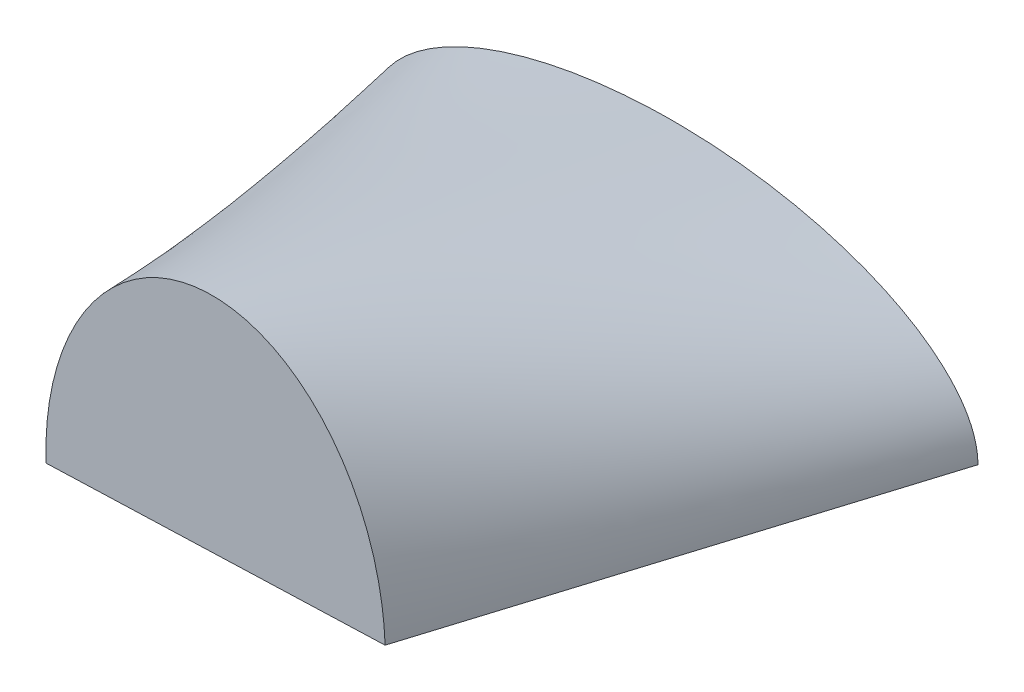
ISO-10303-21;
HEADER;
FILE_DESCRIPTION(('STEP AP214'),'2;1');
FILE_NAME('part.step','',(''),(''),'','','');
FILE_SCHEMA(('AUTOMOTIVE_DESIGN { 1 0 10303 214 1 1 1 1 }'));
ENDSEC;
DATA;
#1=APPLICATION_CONTEXT('core data for automotive mechanical design processes');
#2=APPLICATION_PROTOCOL_DEFINITION('international standard','automotive_design',2000,#1);
#3=PRODUCT_CONTEXT('',#1,'mechanical');
#4=PRODUCT('Part','Part','',(#3));
#5=PRODUCT_RELATED_PRODUCT_CATEGORY('part','',(#4));
#6=PRODUCT_DEFINITION_FORMATION('','',#4);
#7=PRODUCT_DEFINITION_CONTEXT('part definition',#1,'design');
#8=PRODUCT_DEFINITION('design','',#6,#7);
#9=PRODUCT_DEFINITION_SHAPE('','',#8);
#10=(LENGTH_UNIT() NAMED_UNIT(*) SI_UNIT(.MILLI.,.METRE.));
#11=(NAMED_UNIT(*) PLANE_ANGLE_UNIT() SI_UNIT($,.RADIAN.));
#12=(NAMED_UNIT(*) SI_UNIT($,.STERADIAN.) SOLID_ANGLE_UNIT());
#13=UNCERTAINTY_MEASURE_WITH_UNIT(LENGTH_MEASURE(1.E-05),#10,'distance_accuracy_value','');
#14=(GEOMETRIC_REPRESENTATION_CONTEXT(3) GLOBAL_UNCERTAINTY_ASSIGNED_CONTEXT((#13)) GLOBAL_UNIT_ASSIGNED_CONTEXT((#10,
#11,#12)) REPRESENTATION_CONTEXT('',''));
#15=CARTESIAN_POINT('',(0.,0.,0.));
#16=DIRECTION('',(0.,0.,1.));
#17=DIRECTION('',(1.,0.,0.));
#18=AXIS2_PLACEMENT_3D('',#15,#16,#17);
#19=CARTESIAN_POINT('',(62.9135174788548,0.,0.));
#20=DIRECTION('',(0.,0.,-1.));
#21=DIRECTION('',(-1.,0.,0.));
#22=AXIS2_PLACEMENT_3D('',#19,#20,#21);
#23=PLANE('',#22);
#24=DIRECTION('',(-1.,0.,0.));
#25=VECTOR('',#24,1.);
#26=CARTESIAN_POINT('',(0.,0.,0.));
#27=LINE('',#26,#25);
#28=CARTESIAN_POINT('',(62.9135174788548,0.,0.));
#29=VERTEX_POINT('',#28);
#30=CARTESIAN_POINT('',(-62.9135174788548,0.,0.));
#31=VERTEX_POINT('',#30);
#32=EDGE_CURVE('E131',#29,#31,#27,.T.);
#33=ORIENTED_EDGE('',*,*,#32,.T.);
#34=CARTESIAN_POINT('',(62.9135174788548,0.,0.));
#35=CARTESIAN_POINT('',(62.9135592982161,0.299753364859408,0.));
#36=CARTESIAN_POINT('',(62.9041604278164,0.599492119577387,0.));
#37=CARTESIAN_POINT('',(62.8668078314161,1.19746476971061,0.));
#38=CARTESIAN_POINT('',(62.8388756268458,1.49570000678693,0.));
#39=CARTESIAN_POINT('',(62.7647962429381,2.08977229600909,0.));
#40=CARTESIAN_POINT('',(62.7186562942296,2.38561025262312,0.));
#41=CARTESIAN_POINT('',(62.609380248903,2.97053276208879,0.));
#42=CARTESIAN_POINT('',(62.5464495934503,3.25965582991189,0.));
#43=CARTESIAN_POINT('',(62.4040437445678,3.8338689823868,0.));
#44=CARTESIAN_POINT('',(62.324564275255,4.11895800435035,0.));
#45=CARTESIAN_POINT('',(62.149896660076,4.68430660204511,0.));
#46=CARTESIAN_POINT('',(62.0547063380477,4.9645655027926,0.));
#47=CARTESIAN_POINT('',(61.8268319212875,5.58102895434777,0.));
#48=CARTESIAN_POINT('',(61.6905120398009,5.91589243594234,0.));
#49=CARTESIAN_POINT('',(61.3975562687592,6.57664066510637,0.));
#50=CARTESIAN_POINT('',(61.2409166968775,6.90252377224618,0.));
#51=CARTESIAN_POINT('',(60.9091120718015,7.54470165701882,0.));
#52=CARTESIAN_POINT('',(60.7339465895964,7.86099621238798,0.));
#53=CARTESIAN_POINT('',(60.3659867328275,8.48506971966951,0.));
#54=CARTESIAN_POINT('',(60.1731158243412,8.79280341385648,0.));
#55=CARTESIAN_POINT('',(59.7720930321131,9.39808960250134,0.));
#56=CARTESIAN_POINT('',(59.5639423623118,9.69564290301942,0.));
#57=CARTESIAN_POINT('',(59.1338636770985,10.2806218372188,0.));
#58=CARTESIAN_POINT('',(58.911934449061,10.5680465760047,0.));
#59=CARTESIAN_POINT('',(58.3259690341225,11.2934947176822,0.));
#60=CARTESIAN_POINT('',(57.9528776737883,11.7242291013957,0.));
#61=CARTESIAN_POINT('',(57.1808113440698,12.5620762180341,0.));
#62=CARTESIAN_POINT('',(56.7818231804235,12.969176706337,0.));
#63=CARTESIAN_POINT('',(55.9619373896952,13.760787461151,0.));
#64=CARTESIAN_POINT('',(55.5410351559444,14.1452929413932,0.));
#65=CARTESIAN_POINT('',(54.6802559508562,14.8932092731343,0.));
#66=CARTESIAN_POINT('',(54.2403614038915,15.2565998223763,0.));
#67=CARTESIAN_POINT('',(53.3447927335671,15.9630541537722,0.));
#68=CARTESIAN_POINT('',(52.8891232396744,16.3061238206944,0.));
#69=CARTESIAN_POINT('',(51.9641482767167,16.9732353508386,0.));
#70=CARTESIAN_POINT('',(51.4948435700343,17.2972782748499,0.));
#71=CARTESIAN_POINT('',(50.3528284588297,18.0545601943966,0.));
#72=CARTESIAN_POINT('',(49.674383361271,18.479161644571,0.));
#73=CARTESIAN_POINT('',(48.2984302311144,19.2960510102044,-1.03628328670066E-13));
#74=CARTESIAN_POINT('',(47.600922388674,19.6883392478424,0.));
#75=CARTESIAN_POINT('',(46.1908183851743,20.4427182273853,0.));
#76=CARTESIAN_POINT('',(45.4782401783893,20.8048426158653,-1.08474907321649E-13));
#77=CARTESIAN_POINT('',(44.0397825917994,21.501568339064,0.));
#78=CARTESIAN_POINT('',(43.3139027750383,21.836168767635,0.));
#79=CARTESIAN_POINT('',(41.4602584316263,22.6516194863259,0.));
#80=CARTESIAN_POINT('',(40.3248595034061,23.1151634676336,0.));
#81=CARTESIAN_POINT('',(38.0333047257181,23.987784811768,-1.31639444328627E-13));
#82=CARTESIAN_POINT('',(36.8771459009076,24.3968542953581,-1.04460580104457E-13));
#83=CARTESIAN_POINT('',(34.5479732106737,25.1652214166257,-1.0769471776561E-13));
#84=CARTESIAN_POINT('',(33.3749530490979,25.5244998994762,-1.38129818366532E-13));
#85=CARTESIAN_POINT('',(31.0158417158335,26.196800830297,0.));
#86=CARTESIAN_POINT('',(29.8297510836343,26.5098251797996,0.));
#87=CARTESIAN_POINT('',(27.4511245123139,27.0916360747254,0.));
#88=CARTESIAN_POINT('',(26.258624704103,27.3605708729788,0.));
#89=CARTESIAN_POINT('',(23.8652516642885,27.857886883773,-1.48523369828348E-13));
#90=CARTESIAN_POINT('',(22.6643785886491,28.0862688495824,-1.21188560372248E-13));
#91=CARTESIAN_POINT('',(20.2544394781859,28.5046641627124,-1.2203792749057E-13));
#92=CARTESIAN_POINT('',(19.0453650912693,28.6946292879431,-1.50291409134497E-13));
#93=CARTESIAN_POINT('',(16.6218762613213,29.0373615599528,0.));
#94=CARTESIAN_POINT('',(15.4074613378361,29.1901252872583,0.));
#95=CARTESIAN_POINT('',(12.3912925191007,29.5242511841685,0.));
#96=CARTESIAN_POINT('',(10.5871330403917,29.6842018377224,0.));
#97=CARTESIAN_POINT('',(6.97291711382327,29.9279160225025,-1.69795719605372E-13));
#98=CARTESIAN_POINT('',(5.16285833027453,30.0116443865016,-1.40171130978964E-13));
#99=CARTESIAN_POINT('',(1.53993072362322,30.1041243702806,-1.1863245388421E-13));
#100=CARTESIAN_POINT('',(-0.272939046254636,30.1128389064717,-1.26737014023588E-13));
#101=CARTESIAN_POINT('',(-3.89836202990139,30.0553169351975,-1.32304962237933E-13));
#102=CARTESIAN_POINT('',(-5.71091468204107,29.9890447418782,-1.29763282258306E-13));
#103=CARTESIAN_POINT('',(-9.32724405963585,29.7807052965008,-1.27517725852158E-13));
#104=CARTESIAN_POINT('',(-11.1310314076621,29.6388225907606,-1.27806969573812E-13));
#105=CARTESIAN_POINT('',(-14.7303753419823,29.277157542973,-1.2569832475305E-13));
#106=CARTESIAN_POINT('',(-16.5259341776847,29.0573979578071,-1.23301220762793E-13));
#107=CARTESIAN_POINT('',(-19.2096591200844,28.6666573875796,-1.24094201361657E-13));
#108=CARTESIAN_POINT('',(-20.1023637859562,28.5262785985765,-1.25089005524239E-13));
#109=CARTESIAN_POINT('',(-21.8842056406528,28.2245145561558,-1.1884487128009E-13));
#110=CARTESIAN_POINT('',(-22.7733429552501,28.0631300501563,-1.11606225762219E-13));
#111=CARTESIAN_POINT('',(-24.546825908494,27.7187405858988,-1.28038537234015E-13));
#112=CARTESIAN_POINT('',(-25.4311742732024,27.5357496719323,-1.51689515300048E-13));
#113=CARTESIAN_POINT('',(-27.1948709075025,27.1472101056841,0.));
#114=CARTESIAN_POINT('',(-28.0742194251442,26.9416625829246,0.));
#115=CARTESIAN_POINT('',(-29.6766960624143,26.5442814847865,0.));
#116=CARTESIAN_POINT('',(-30.4007422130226,26.3561455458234,0.));
#117=CARTESIAN_POINT('',(-31.8441833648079,25.963043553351,-1.39662431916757E-13));
#118=CARTESIAN_POINT('',(-32.5635788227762,25.7580791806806,-1.17537798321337E-13));
#119=CARTESIAN_POINT('',(-33.9971189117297,25.330549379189,-1.01365896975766E-13));
#120=CARTESIAN_POINT('',(-34.7112636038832,25.1079841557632,-1.07318301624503E-13));
#121=CARTESIAN_POINT('',(-36.1359671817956,24.6435956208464,-1.05675446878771E-13));
#122=CARTESIAN_POINT('',(-36.846505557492,24.4017092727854,0.));
#123=CARTESIAN_POINT('',(-38.2606425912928,23.8983387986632,-1.08542637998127E-13));
#124=CARTESIAN_POINT('',(-38.9642410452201,23.63685409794,-1.26693568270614E-13));
#125=CARTESIAN_POINT('',(-40.3634202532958,23.0931474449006,0.));
#126=CARTESIAN_POINT('',(-41.0590007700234,22.8109248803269,0.));
#127=CARTESIAN_POINT('',(-42.4357861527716,22.2265914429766,0.));
#128=CARTESIAN_POINT('',(-43.1170589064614,21.9246408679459,0.));
#129=CARTESIAN_POINT('',(-44.4689605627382,21.29754348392,-1.16350270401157E-13));
#130=CARTESIAN_POINT('',(-45.1395883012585,20.9723941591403,0.));
#131=CARTESIAN_POINT('',(-46.4684882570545,20.2971567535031,0.));
#132=CARTESIAN_POINT('',(-47.1267562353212,19.9470603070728,0.));
#133=CARTESIAN_POINT('',(-48.4290312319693,19.2197885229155,0.));
#134=CARTESIAN_POINT('',(-49.0730240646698,18.8425877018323,0.));
#135=CARTESIAN_POINT('',(-50.3391662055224,18.0617620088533,0.));
#136=CARTESIAN_POINT('',(-50.9614289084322,17.6583216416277,0.));
#137=CARTESIAN_POINT('',(-52.184784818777,16.8205681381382,0.));
#138=CARTESIAN_POINT('',(-52.7858808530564,16.386259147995,0.));
#139=CARTESIAN_POINT('',(-53.9617384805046,15.4847077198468,0.));
#140=CARTESIAN_POINT('',(-54.5365326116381,15.0175078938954,0.));
#141=CARTESIAN_POINT('',(-55.6542618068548,14.0474762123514,0.));
#142=CARTESIAN_POINT('',(-56.1972346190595,13.5446882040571,0.));
#143=CARTESIAN_POINT('',(-57.09932222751,12.6452662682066,0.));
#144=CARTESIAN_POINT('',(-57.4676576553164,12.2578742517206,0.));
#145=CARTESIAN_POINT('',(-58.1808074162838,11.4619480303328,0.));
#146=CARTESIAN_POINT('',(-58.5256232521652,11.0534151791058,0.));
#147=CARTESIAN_POINT('',(-59.1880010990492,10.2142090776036,0.));
#148=CARTESIAN_POINT('',(-59.5055409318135,9.78351825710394,0.));
#149=CARTESIAN_POINT('',(-60.1084210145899,8.89998422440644,0.));
#150=CARTESIAN_POINT('',(-60.3937613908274,8.44714109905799,0.));
#151=CARTESIAN_POINT('',(-60.840634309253,7.66990191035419,0.));
#152=CARTESIAN_POINT('',(-61.0123579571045,7.35134215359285,0.));
#153=CARTESIAN_POINT('',(-61.3369076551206,6.70466770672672,0.));
#154=CARTESIAN_POINT('',(-61.4897326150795,6.37655246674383,0.));
#155=CARTESIAN_POINT('',(-61.774707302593,5.71134966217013,0.));
#156=CARTESIAN_POINT('',(-61.9068523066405,5.3742600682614,0.));
#157=CARTESIAN_POINT('',(-62.1482428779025,4.69328526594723,0.));
#158=CARTESIAN_POINT('',(-62.2575675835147,4.3494282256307,0.));
#159=CARTESIAN_POINT('',(-62.452263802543,3.65505853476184,0.));
#160=CARTESIAN_POINT('',(-62.5376401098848,3.3045472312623,0.));
#161=CARTESIAN_POINT('',(-62.6830134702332,2.59858559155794,0.));
#162=CARTESIAN_POINT('',(-62.7430347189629,2.24314029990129,0.));
#163=CARTESIAN_POINT('',(-62.8104071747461,1.72974422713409,0.));
#164=CARTESIAN_POINT('',(-62.8283969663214,1.57312994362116,0.));
#165=CARTESIAN_POINT('',(-62.8592796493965,1.259433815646,0.));
#166=CARTESIAN_POINT('',(-62.8721738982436,1.10235210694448,0.));
#167=CARTESIAN_POINT('',(-62.8928244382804,0.787831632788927,0.));
#168=CARTESIAN_POINT('',(-62.9005800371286,0.630392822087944,0.));
#169=CARTESIAN_POINT('',(-62.9109288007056,0.315303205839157,0.));
#170=CARTESIAN_POINT('',(-62.9135205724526,0.157652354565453,0.));
#171=CARTESIAN_POINT('',(-62.9135174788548,0.,0.));
#172=B_SPLINE_CURVE_WITH_KNOTS('',3,(#34,#35,#36,#37,#38,#39,#40,#41,#42,#43,#44,#45,#46,#47,
#48,#49,#50,#51,#52,#53,#54,#55,#56,#57,#58,#59,#60,#61,#62,#63,#64,#65,#66,#67,#68,#69,#70,#71,
#72,#73,#74,#75,#76,#77,#78,#79,#80,#81,#82,#83,#84,#85,#86,#87,#88,#89,#90,#91,#92,#93,#94,#95,
#96,#97,#98,#99,#100,#101,#102,#103,#104,#105,#106,#107,#108,#109,#110,#111,#112,#113,#114,#115,
#116,#117,#118,#119,#120,#121,#122,#123,#124,#125,#126,#127,#128,#129,#130,#131,#132,#133,#134,
#135,#136,#137,#138,#139,#140,#141,#142,#143,#144,#145,#146,#147,#148,#149,#150,#151,#152,#153,
#154,#155,#156,#157,#158,#159,#160,#161,#162,#163,#164,#165,#166,#167,#168,#169,#170,#171),
.UNSPECIFIED.,.F.,.F.,(4,2,2,2,2,2,2,2,2,2,2,2,2,2,2,2,2,2,2,2,2,2,2,2,2,2,2,2,2,2,2,2,2,2,2,2,
2,2,2,2,2,2,2,2,2,2,2,2,2,2,2,2,2,2,2,2,2,2,2,2,2,2,2,2,2,2,2,2,4),(0.,0.899089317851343,
1.79713641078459,2.69482723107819,3.58200165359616,4.46940558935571,5.35693254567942,
6.44082397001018,7.52491209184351,8.60902532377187,9.6980678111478,10.7870238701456,
11.8760759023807,13.5843214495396,15.293444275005,17.0029278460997,18.7140287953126,
20.42463177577,22.1351392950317,24.5351622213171,26.93516121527,29.3324462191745,
31.7298101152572,35.407257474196,39.0852361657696,42.7646258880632,46.4438643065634,
50.1104654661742,53.7769985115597,57.4481057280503,61.1195502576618,66.5514834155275,
71.9859214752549,77.4230459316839,82.8627589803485,88.2892554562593,93.714167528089,
96.4249870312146,99.135710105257,101.844680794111,104.553515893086,106.797596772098,
109.041453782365,111.285284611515,113.53676114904,115.7883037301,118.039912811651,
120.275078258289,122.510486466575,124.74664783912,126.984939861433,129.208911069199,
131.432584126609,133.65342749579,135.871580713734,137.474429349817,139.077175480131,
140.681212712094,142.285243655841,143.370391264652,144.455601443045,145.541059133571,
146.622687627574,147.70409944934,148.784476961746,149.257344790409,149.730086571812,
150.202892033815,150.67582502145),.UNSPECIFIED.);
#173=EDGE_CURVE('E115',#29,#31,#172,.T.);
#174=ORIENTED_EDGE('',*,*,#173,.F.);
#175=EDGE_LOOP('',(#33,#174));
#176=FACE_BOUND('',#175,.T.);
#177=ADVANCED_FACE('F111',(#176),#23,.T.);
#178=CARTESIAN_POINT('',(35.1102611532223,1.22699009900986,95.));
#179=CARTESIAN_POINT('',(-35.1102611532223,-1.22699009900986,95.));
#180=CARTESIAN_POINT('',(62.9135174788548,0.,0.));
#181=CARTESIAN_POINT('',(-62.9135174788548,0.,0.));
#182=B_SPLINE_SURFACE_WITH_KNOTS('',1,1,((#178,#179),(#180,#181)),.UNSPECIFIED.,.F.,.F.,.F.,(2,
2),(2,2),(0.,1.),(0.,1.),.UNSPECIFIED.);
#183=DIRECTION('',(0.280862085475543,-0.0123947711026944,-0.959668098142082));
#184=VECTOR('',#183,1.);
#185=CARTESIAN_POINT('',(49.0118893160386,0.61349504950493,47.5));
#186=LINE('',#185,#184);
#187=CARTESIAN_POINT('',(35.1102611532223,1.22699009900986,95.));
#188=VERTEX_POINT('',#187);
#189=EDGE_CURVE('E125',#188,#29,#186,.T.);
#190=DIRECTION('',(-0.999389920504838,-0.034925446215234,0.));
#191=VECTOR('',#190,1.);
#192=CARTESIAN_POINT('',(0.,0.,95.));
#193=LINE('',#192,#191);
#194=CARTESIAN_POINT('',(-35.1102611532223,-1.22699009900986,95.));
#195=VERTEX_POINT('',#194);
#196=EDGE_CURVE('E142',#188,#195,#193,.T.);
#197=DIRECTION('',(0.280862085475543,-0.0123947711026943,0.959668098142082));
#198=VECTOR('',#197,1.);
#199=CARTESIAN_POINT('',(-49.0118893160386,-0.613495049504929,47.5));
#200=LINE('',#199,#198);
#201=EDGE_CURVE('E146',#31,#195,#200,.T.);
#202=ORIENTED_EDGE('',*,*,#189,.F.);
#203=ORIENTED_EDGE('',*,*,#196,.T.);
#204=ORIENTED_EDGE('',*,*,#201,.F.);
#205=ORIENTED_EDGE('',*,*,#32,.F.);
#206=EDGE_LOOP('',(#202,#203,#204,#205));
#207=FACE_BOUND('',#206,.T.);
#208=ADVANCED_FACE('F144',(#207),#182,.F.);
#209=CARTESIAN_POINT('',(35.1102611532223,1.22699009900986,95.));
#210=DIRECTION('',(0.,0.,-1.));
#211=DIRECTION('',(-0.999389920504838,-0.0349254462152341,0.));
#212=AXIS2_PLACEMENT_3D('',#209,#210,#211);
#213=PLANE('',#212);
#214=ORIENTED_EDGE('',*,*,#196,.F.);
#215=CARTESIAN_POINT('',(-35.1102611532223,-1.22699009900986,95.));
#216=CARTESIAN_POINT('',(-35.1490456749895,-0.116067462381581,95.));
#217=CARTESIAN_POINT('',(-35.1572705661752,0.995948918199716,95.));
#218=CARTESIAN_POINT('',(-35.1121801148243,3.21982357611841,95.0000000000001));
#219=CARTESIAN_POINT('',(-35.0588042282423,4.33168062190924,95.0000000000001));
#220=CARTESIAN_POINT('',(-34.8899811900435,6.55111422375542,95.0000000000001));
#221=CARTESIAN_POINT('',(-34.7745104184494,7.65868898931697,95.0000000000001));
#222=CARTESIAN_POINT('',(-34.4796656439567,9.87407213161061,95.0000000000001));
#223=CARTESIAN_POINT('',(-34.2998030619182,10.9818157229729,95.0000000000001));
#224=CARTESIAN_POINT('',(-33.8755184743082,13.1845245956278,95.0000000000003));
#225=CARTESIAN_POINT('',(-33.6311171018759,14.2794938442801,95.0000000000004));
#226=CARTESIAN_POINT('',(-33.07670116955,16.4524350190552,95.0000000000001));
#227=CARTESIAN_POINT('',(-32.7667064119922,17.5304119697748,94.9999999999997));
#228=CARTESIAN_POINT('',(-32.1598435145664,19.4162024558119,94.9999999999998));
#229=CARTESIAN_POINT('',(-31.8767324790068,20.2284659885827,95.0000000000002));
#230=CARTESIAN_POINT('',(-31.2705352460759,21.8379315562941,95.0000000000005));
#231=CARTESIAN_POINT('',(-30.9474519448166,22.6351346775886,95.0000000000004));
#232=CARTESIAN_POINT('',(-30.2606544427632,24.2119006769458,95.0000000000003));
#233=CARTESIAN_POINT('',(-29.8969367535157,24.9914620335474,95.0000000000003));
#234=CARTESIAN_POINT('',(-28.9376831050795,26.9114042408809,95.0000000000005));
#235=CARTESIAN_POINT('',(-28.3165870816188,28.0391543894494,95.0000000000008));
#236=CARTESIAN_POINT('',(-26.9800865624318,30.2375079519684,95.));
#237=CARTESIAN_POINT('',(-26.2646990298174,31.3081215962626,94.9999999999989));
#238=CARTESIAN_POINT('',(-25.2057437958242,32.7450023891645,94.9999999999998));
#239=CARTESIAN_POINT('',(-24.9025330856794,33.1413778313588,95.0000000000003));
#240=CARTESIAN_POINT('',(-24.2817812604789,33.9226090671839,95.0000000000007));
#241=CARTESIAN_POINT('',(-23.9642433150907,34.3074673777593,95.0000000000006));
#242=CARTESIAN_POINT('',(-22.9900048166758,35.4435739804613,95.0000000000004));
#243=CARTESIAN_POINT('',(-22.3116046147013,36.1764561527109,95.0000000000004));
#244=CARTESIAN_POINT('',(-20.8982614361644,37.5846134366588,95.0000000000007));
#245=CARTESIAN_POINT('',(-20.1633542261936,38.2599244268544,95.0000000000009));
#246=CARTESIAN_POINT('',(-18.6381502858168,39.5449244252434,95.0000000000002));
#247=CARTESIAN_POINT('',(-17.8478626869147,40.154624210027,94.9999999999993));
#248=CARTESIAN_POINT('',(-16.3538921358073,41.2018286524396,94.9999999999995));
#249=CARTESIAN_POINT('',(-15.6583592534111,41.6509796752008,95.0000000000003));
#250=CARTESIAN_POINT('',(-14.2337095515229,42.4924954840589,95.0000000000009));
#251=CARTESIAN_POINT('',(-13.5045962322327,42.8848661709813,95.0000000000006));
#252=CARTESIAN_POINT('',(-12.0164976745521,43.607451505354,95.0000000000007));
#253=CARTESIAN_POINT('',(-11.2575243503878,43.9376906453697,95.000000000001));
#254=CARTESIAN_POINT('',(-9.71370036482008,44.5313545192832,95.0000000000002));
#255=CARTESIAN_POINT('',(-8.92884937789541,44.7947784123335,94.9999999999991));
#256=CARTESIAN_POINT('',(-7.60113458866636,45.1753929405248,94.9999999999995));
#257=CARTESIAN_POINT('',(-7.0638068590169,45.3121615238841,95.0000000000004));
#258=CARTESIAN_POINT('',(-5.98177542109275,45.5528100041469,95.000000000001));
#259=CARTESIAN_POINT('',(-5.43707150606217,45.6566889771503,95.0000000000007));
#260=CARTESIAN_POINT('',(-4.34231271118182,45.830752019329,95.0000000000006));
#261=CARTESIAN_POINT('',(-3.79225787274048,45.900936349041,95.0000000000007));
#262=CARTESIAN_POINT('',(-2.68899036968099,46.0070934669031,95.0000000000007));
#263=CARTESIAN_POINT('',(-2.13577852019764,46.0430747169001,95.0000000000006));
#264=CARTESIAN_POINT('',(-1.02817569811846,46.0806330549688,95.0000000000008));
#265=CARTESIAN_POINT('',(-0.473784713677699,46.0822097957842,95.000000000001));
#266=CARTESIAN_POINT('',(0.633945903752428,46.0510492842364,95.0000000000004));
#267=CARTESIAN_POINT('',(1.18728563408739,46.0183153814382,94.9999999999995));
#268=CARTESIAN_POINT('',(2.49513656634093,45.9004883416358,94.9999999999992));
#269=CARTESIAN_POINT('',(3.24835092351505,45.8005065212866,95.0000000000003));
#270=CARTESIAN_POINT('',(4.74378323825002,45.5385980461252,95.000000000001));
#271=CARTESIAN_POINT('',(5.48600192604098,45.3766755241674,95.0000000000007));
#272=CARTESIAN_POINT('',(6.95506727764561,44.9934745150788,95.0000000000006));
#273=CARTESIAN_POINT('',(7.68191111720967,44.772185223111,95.0000000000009));
#274=CARTESIAN_POINT('',(9.116058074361,44.273516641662,95.0000000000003));
#275=CARTESIAN_POINT('',(9.82336042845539,43.9961351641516,94.9999999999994));
#276=CARTESIAN_POINT('',(11.245612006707,43.375629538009,94.9999999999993));
#277=CARTESIAN_POINT('',(11.9595337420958,43.0301538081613,95.0000000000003));
#278=CARTESIAN_POINT('',(13.3593633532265,42.2865403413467,95.0000000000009));
#279=CARTESIAN_POINT('',(14.0452695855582,41.8883995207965,95.0000000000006));
#280=CARTESIAN_POINT('',(15.3865780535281,41.0440855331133,95.0000000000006));
#281=CARTESIAN_POINT('',(16.0419870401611,40.5979230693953,95.0000000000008));
#282=CARTESIAN_POINT('',(17.3206823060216,39.6620281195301,95.0000000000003));
#283=CARTESIAN_POINT('',(17.943971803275,39.1723000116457,94.9999999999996));
#284=CARTESIAN_POINT('',(19.4182454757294,37.9344182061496,94.9999999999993));
#285=CARTESIAN_POINT('',(20.2519926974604,37.1656391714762,95.0000000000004));
#286=CARTESIAN_POINT('',(21.8494485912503,35.5594521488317,95.0000000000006));
#287=CARTESIAN_POINT('',(22.6131819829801,34.7220685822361,94.9999999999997));
#288=CARTESIAN_POINT('',(24.0768399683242,32.9810752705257,94.9999999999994));
#289=CARTESIAN_POINT('',(24.7761583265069,32.0769572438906,95.0000000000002));
#290=CARTESIAN_POINT('',(26.1040133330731,30.2178004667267,95.0000000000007));
#291=CARTESIAN_POINT('',(26.7325219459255,29.2627417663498,95.0000000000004));
#292=CARTESIAN_POINT('',(27.9205200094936,27.3079077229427,95.0000000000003));
#293=CARTESIAN_POINT('',(28.4798573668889,26.3080402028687,95.0000000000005));
#294=CARTESIAN_POINT('',(29.5288940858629,24.2726357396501,95.0000000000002));
#295=CARTESIAN_POINT('',(30.0185982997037,23.2371012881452,94.9999999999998));
#296=CARTESIAN_POINT('',(31.0003588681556,20.9730265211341,94.9999999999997));
#297=CARTESIAN_POINT('',(31.4809459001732,19.7395080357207,95.0000000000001));
#298=CARTESIAN_POINT('',(32.3523151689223,17.2410175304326,95.0000000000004));
#299=CARTESIAN_POINT('',(32.743079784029,15.9760393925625,95.0000000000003));
#300=CARTESIAN_POINT('',(33.435699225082,13.4234079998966,95.0000000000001));
#301=CARTESIAN_POINT('',(33.7376427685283,12.1357787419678,95.0000000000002));
#302=CARTESIAN_POINT('',(34.2540721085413,9.54351015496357,95.0000000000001));
#303=CARTESIAN_POINT('',(34.4685852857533,8.23887628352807,95.));
#304=CARTESIAN_POINT('',(34.7633953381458,5.9820770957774,94.9999999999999));
#305=CARTESIAN_POINT('',(34.8644181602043,5.03256128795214,95.));
#306=CARTESIAN_POINT('',(35.0211585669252,3.13130041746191,95.0000000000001));
#307=CARTESIAN_POINT('',(35.076947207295,2.17956121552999,95.0000000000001));
#308=CARTESIAN_POINT('',(35.1102611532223,1.22699009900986,95.));
#309=B_SPLINE_CURVE_WITH_KNOTS('',3,(#215,#216,#217,#218,#219,#220,#221,#222,#223,#224,#225,
#226,#227,#228,#229,#230,#231,#232,#233,#234,#235,#236,#237,#238,#239,#240,#241,#242,#243,#244,
#245,#246,#247,#248,#249,#250,#251,#252,#253,#254,#255,#256,#257,#258,#259,#260,#261,#262,#263,
#264,#265,#266,#267,#268,#269,#270,#271,#272,#273,#274,#275,#276,#277,#278,#279,#280,#281,#282,
#283,#284,#285,#286,#287,#288,#289,#290,#291,#292,#293,#294,#295,#296,#297,#298,#299,#300,#301,
#302,#303,#304,#305,#306,#307,#308),.UNSPECIFIED.,.F.,.F.,(4,2,2,2,2,2,2,2,2,2,2,2,2,2,2,2,2,2,
2,2,2,2,2,2,2,2,2,2,2,2,2,2,2,2,2,2,2,2,2,2,2,2,2,2,2,2,4),(0.,3.33441954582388,
6.67211910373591,10.0110891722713,13.3759504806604,16.7397373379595,20.1025101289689,
22.6821077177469,25.2615185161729,27.8411509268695,31.6991081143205,35.5563721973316,
37.0532462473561,38.5497907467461,41.5425004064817,44.5333311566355,47.5236699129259,
50.0051005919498,52.4862732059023,54.9664656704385,57.446689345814,59.109144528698,
60.7716464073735,62.4341354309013,64.0962130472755,65.7583074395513,67.4202395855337,
69.6969116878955,71.9734319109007,74.2503667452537,76.5273904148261,78.9043781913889,
81.2815052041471,83.6581034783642,86.0344631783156,89.4318819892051,92.8280966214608,
96.2535625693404,99.6803800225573,103.114603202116,106.548586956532,110.516415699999,
114.485022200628,118.449651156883,122.413037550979,125.276642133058,128.135739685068),.UNSPECIFIED.);
#310=EDGE_CURVE('E12',#195,#188,#309,.T.);
#311=ORIENTED_EDGE('',*,*,#310,.F.);
#312=EDGE_LOOP('',(#214,#311));
#313=FACE_BOUND('',#312,.T.);
#314=ADVANCED_FACE('F151',(#313),#213,.F.);
#315=CARTESIAN_POINT('',(-35.1102611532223,-1.22699009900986,95.));
#316=CARTESIAN_POINT('',(-62.9135174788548,0.,0.));
#317=CARTESIAN_POINT('',(-38.3296201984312,90.8948101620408,95.));
#318=CARTESIAN_POINT('',(-62.9135174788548,60.2012453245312,0.));
#319=CARTESIAN_POINT('',(31.8909021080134,93.3487903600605,95.));
#320=CARTESIAN_POINT('',(62.9135174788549,60.2012453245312,0.));
#321=CARTESIAN_POINT('',(35.1102611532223,1.22699009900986,95.));
#322=CARTESIAN_POINT('',(62.9135174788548,0.,0.));
#323=(BOUNDED_SURFACE() B_SPLINE_SURFACE(3,1,((#315,#316),(#317,#318),(#319,#320),(#321,#322)),
.UNSPECIFIED.,.F.,.F.,.F.) B_SPLINE_SURFACE_WITH_KNOTS((4,4),(2,2),(0.,1.),(0.,1.),
.UNSPECIFIED.) GEOMETRIC_REPRESENTATION_ITEM() RATIONAL_B_SPLINE_SURFACE(((1.,1.),
(0.333333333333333,0.333333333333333),(0.333333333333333,0.333333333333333),(1.,1.))) REPRESENTATION_ITEM('') SURFACE());
#324=ORIENTED_EDGE('',*,*,#310,.T.);
#325=ORIENTED_EDGE('',*,*,#189,.T.);
#326=ORIENTED_EDGE('',*,*,#173,.T.);
#327=ORIENTED_EDGE('',*,*,#201,.T.);
#328=EDGE_LOOP('',(#324,#325,#326,#327));
#329=FACE_BOUND('',#328,.T.);
#330=ADVANCED_FACE('F153',(#329),#323,.T.);
#331=CLOSED_SHELL('',(#177,#208,#314,#330));
#332=MANIFOLD_SOLID_BREP('B2',#331);
#333=ADVANCED_BREP_SHAPE_REPRESENTATION('',(#18,#332),#14);
#334=SHAPE_DEFINITION_REPRESENTATION(#9,#333);
ENDSEC;
END-ISO-10303-21;
